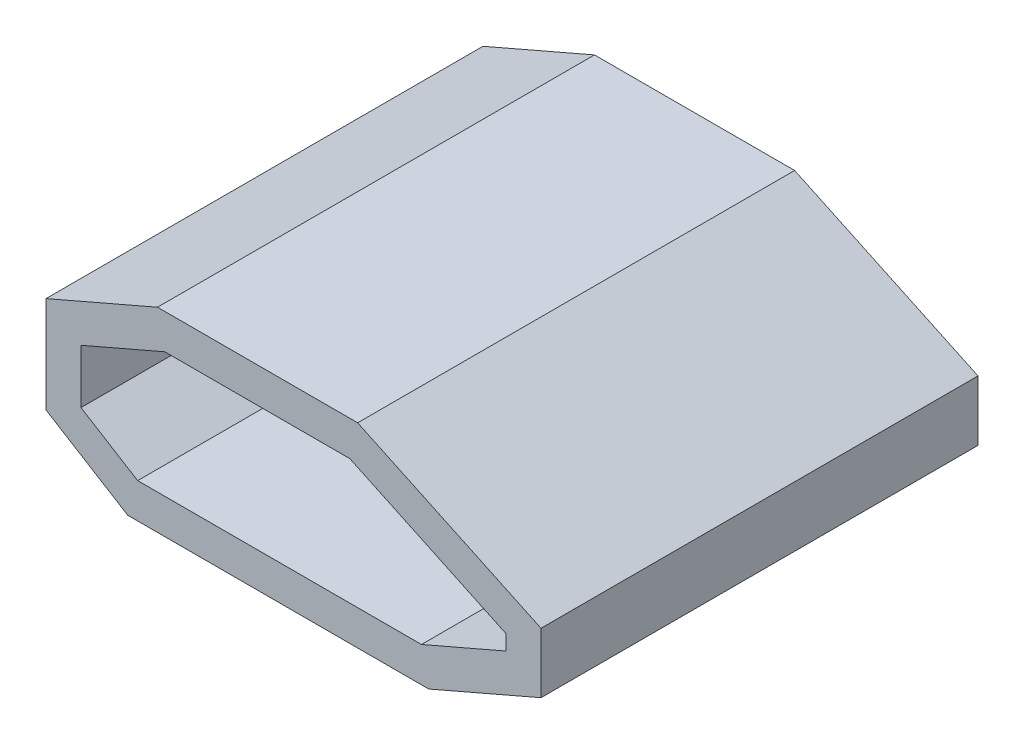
from build123d import *

# Parameters (mm, degrees)
EXTRUDE_THIN1_DEPTH = 125


with BuildPart() as part:
    # Sketch1 → Extrude-Thin1 (new, symmetric)
    with BuildSketch(Plane.XY):
        Polygon((-10, -5.587304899), (-10, 49.59854779), (53.771666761, 77.205329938), (168.285037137, 77.205329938), (273.174138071, 27.862338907), (273.174138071, -6.567796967), (208.938337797, -34.375502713), (36.770487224, -34.375502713), align=None)
        Polygon((10, 5.587304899), (10, 36.462953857), (57.914888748, 57.205329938), (163.815660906, 57.205329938), (253.174138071, 15.168411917), (253.174138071, 6.567796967), (204.79511581, -14.375502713), (42.432396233, -14.375502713), align=None, mode=Mode.SUBTRACT)
    extrude(amount=EXTRUDE_THIN1_DEPTH, both=True)


solid = part.part
